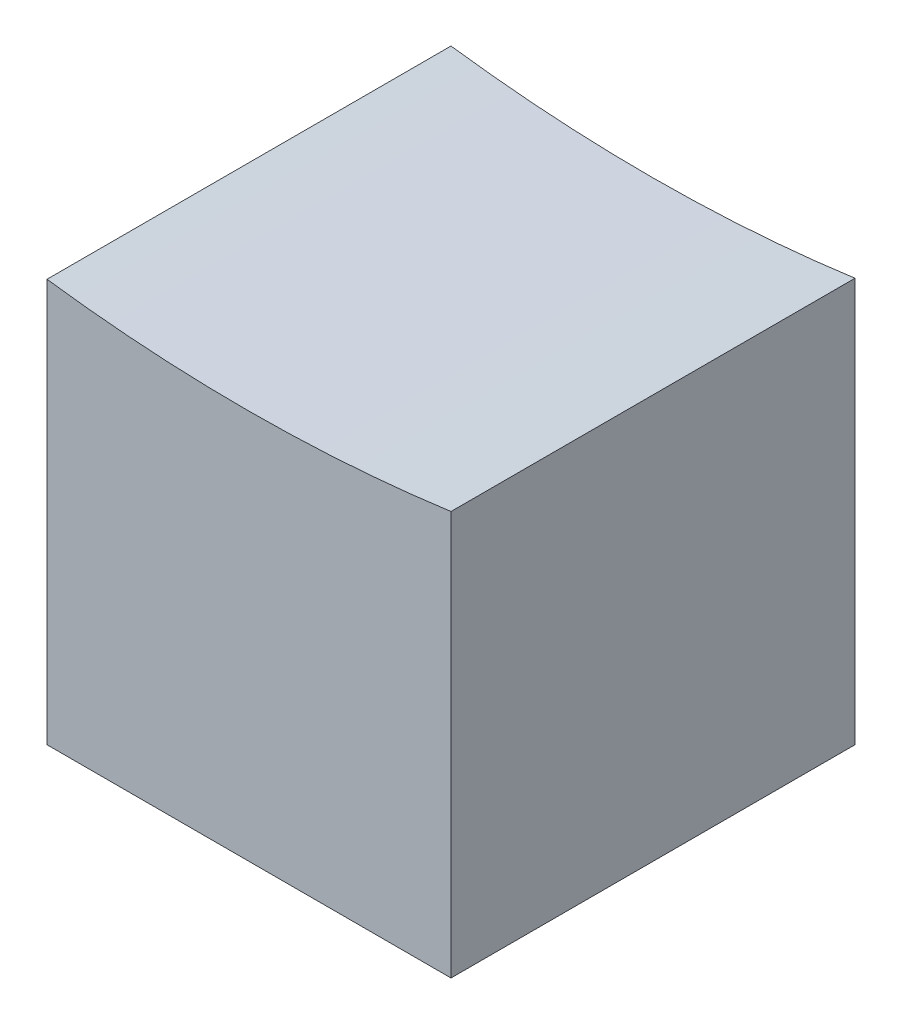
from build123d import *

# Parameters (mm, degrees)
BOSS_EXTRUDE1_DEPTH = 30


with BuildPart() as part:
    # Sketch1 → Boss-Extrude1 (new body)
    with BuildSketch(Plane.XY):
        with BuildLine():
            Line((-14.75582861, -110.317521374), (-14.75582861, -140.25110085))
            Line((-14.75582861, -140.25110085), (15.24417139, -140.25110085))
            Line((15.24417139, -140.25110085), (15.24417139, -110.25110085))
            ThreePointArc((15.24417139, -110.25110085), (0.246419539, -111.299727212), (-14.75582861, -110.317521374))
        make_face()
    extrude(amount=BOSS_EXTRUDE1_DEPTH)


solid = part.part
